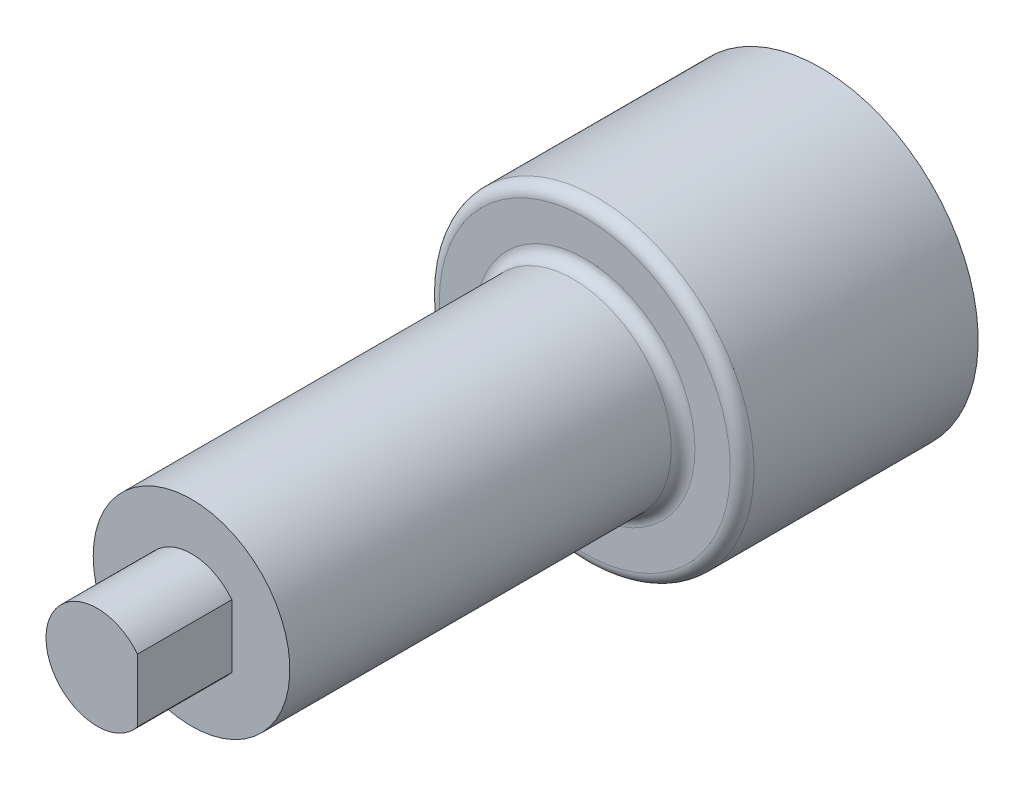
from build123d import *

# Parameters (mm, degrees)
EXTRUDE1_DEPTH = 12
SKETCH2_R      = 12.5
EXTRUDE2_DEPTH = 50
SKETCH3_R      = 20
EXTRUDE3_DEPTH = 30
FILLET1_R      = 1.5


with BuildPart() as part:
    # Sketch1 → Extrude1 (new body)
    with BuildSketch(Plane.XY):
        with BuildLine():
            Line((5.123475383, -4), (5.123475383, 4))
            ThreePointArc((5.123475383, 4), (-6.5, 0), (5.123475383, -4))
        make_face()
    extrude(amount=-EXTRUDE1_DEPTH)

    # Sketch2 → Extrude2 (add)
    with BuildSketch(Plane(origin=(0, 0, -12), x_dir=(-1, 0, 0), z_dir=(0, 0, -1))):
        Circle(SKETCH2_R)
    extrude(amount=EXTRUDE2_DEPTH)

    # Sketch3 → Extrude3 (add)
    with BuildSketch(Plane(origin=(0, 0, -62), x_dir=(-1, 0, 0), z_dir=(0, 0, -1))):
        Circle(SKETCH3_R)
    extrude(amount=EXTRUDE3_DEPTH)

    # Fillet1
    fillet1_edges = [part.edges().sort_by_distance(p)[0] for p in [
        (20, 0, -62),
        (12.5, 0, -62),
    ]]
    fillet(fillet1_edges, radius=FILLET1_R)


solid = part.part
